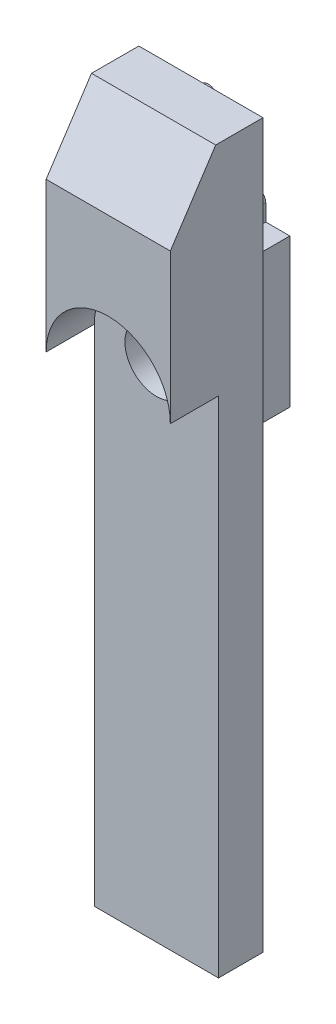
from build123d import *

# Parameters (mm, degrees)
SKETCH_1_W               = 33.5
SKETCH_1_H               = 195
EXTRUDE_1_DEPTH          = 25
CUT_EXTRUDE_2_DEPTH      = 13
CUT_EXTRUDE_3_DEPTH      = 107.082515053
CUT_EXTRUDE_3_DEPTH_BACK = 107.082515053
SKETCH_4_R               = 8.5
CUT_EXTRUDE_4_DEPTH      = 100.778817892
SKETCH_5_R               = 8.5
EXTRUDE_5_DEPTH          = 15
SKETCH_6_R               = 2.5
EXTRUDE_6_DEPTH          = 2


with BuildPart() as part:
    # Sketch 1 → Extrude 1 (new body)
    with BuildSketch(Plane.XY):
        Rectangle(SKETCH_1_W, SKETCH_1_H)
    extrude(amount=EXTRUDE_1_DEPTH)

    # Sketch 2 → Cut-Extrude 2 (cut)
    with BuildSketch(Plane.XY.offset(25)):
        with BuildLine():
            Line((-16.75, -97.5), (16.75, -97.5))
            Line((16.75, -97.5), (16.75, 38.5))
            ThreePointArc((16.75, 38.5), (0, 55.25), (-16.75, 38.5))
            Line((-16.75, 38.5), (-16.75, -97.5))
        make_face()
    extrude(amount=-CUT_EXTRUDE_2_DEPTH, mode=Mode.SUBTRACT)

    # Sketch 3 → Cut-Extrude 3 (cut, two sides: drawn at the far end of the back side and taken through both)
    with BuildSketch(Plane.ZY.offset(16.75).offset(-CUT_EXTRUDE_3_DEPTH_BACK)):
        Polygon((-227.006924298, 462.86200887), (5.539164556, 108.50606395), (31.402864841, 69.094711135), (263.948953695, -285.261233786), (972.660843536, 179.830943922), (481.704965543, 927.954186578), align=None)
    extrude(amount=CUT_EXTRUDE_3_DEPTH + CUT_EXTRUDE_3_DEPTH_BACK, mode=Mode.SUBTRACT)

    # Sketch 4 → Cut-Extrude 4 (cut, through all)
    with BuildSketch(Plane.XY.offset(12)):
        with Locations((0, 38.5)):
            Circle(SKETCH_4_R)
    extrude(amount=-CUT_EXTRUDE_4_DEPTH, mode=Mode.SUBTRACT)

    # Sketch 5 → Extrude 5 (add)
    with BuildSketch(Plane(origin=(0, 0, 0), x_dir=(-1, 0, 0), z_dir=(0, 0, -1))):
        with BuildLine():
            Line((2.5, 58.5), (9, 58.5))
            Line((9, 58.5), (9, 18.5))
            Line((9, 18.5), (2.5, 18.5))
            Line((2.5, 18.5), (2.5, 14))
            ThreePointArc((2.5, 14), (0, 11.5), (-2.5, 14))
            Line((-2.5, 14), (-2.5, 18.5))
            Line((-2.5, 18.5), (-9, 18.5))
            Line((-9, 18.5), (-9, 58.5))
            Line((-9, 58.5), (-2.5, 58.5))
            Line((-2.5, 58.5), (-2.5, 63))
            ThreePointArc((-2.5, 63), (0, 65.5), (2.5, 63))
            Line((2.5, 63), (2.5, 58.5))
        make_face()
        with Locations(Location((0, 38.5, 0), (0, 0, 180))):
            Circle(SKETCH_5_R, mode=Mode.SUBTRACT)
    extrude(amount=EXTRUDE_5_DEPTH)

    # Sketch 6 → Extrude 6 (add)
    with BuildSketch(Plane(origin=(0, 0, 0), x_dir=(-1, 0, 0), z_dir=(0, 0, -1))):
        with Locations((0, 93.5)):
            Circle(SKETCH_6_R)
        with Locations((0, -71.5)):
            Circle(SKETCH_6_R)
    extrude(amount=EXTRUDE_6_DEPTH)


solid = part.part
